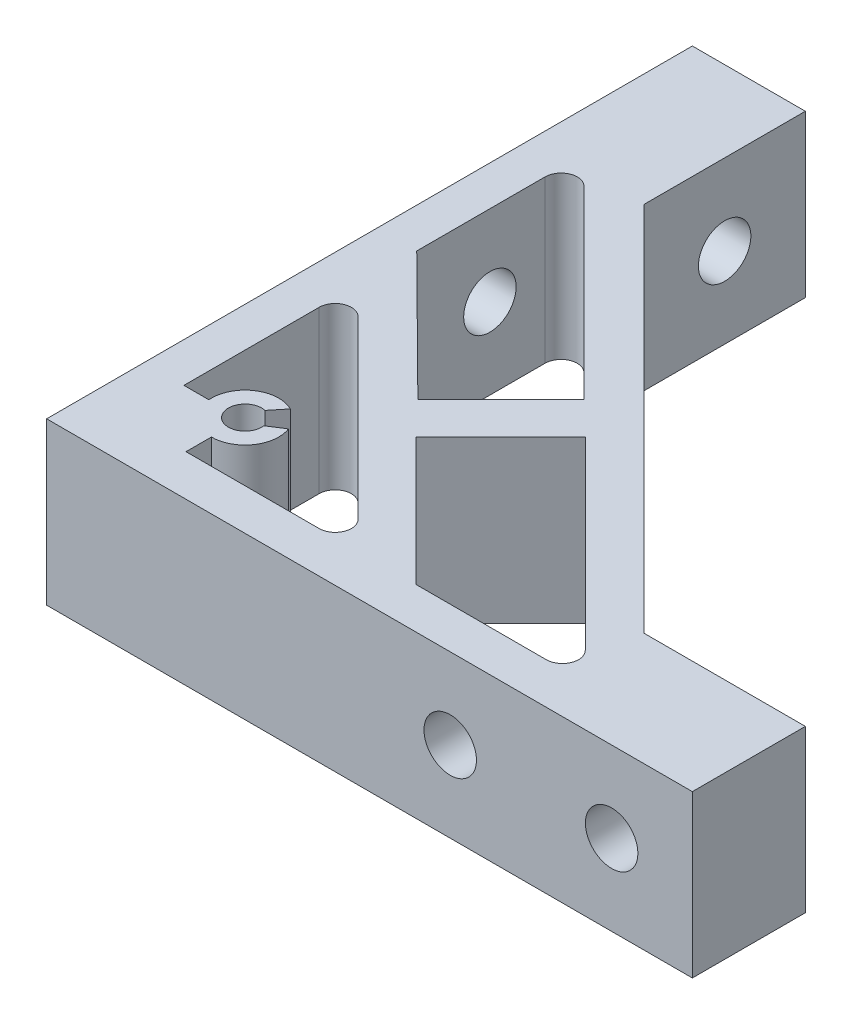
from build123d import *

# Parameters (mm, degrees)
EXTRUDE_1_DEPTH     = 20
SKETCH_2_R          = 3.25
CUT_EXTRUDE_1_DEPTH = 115.891252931
SKETCH_3_R          = 3.25
CUT_EXTRUDE_2_DEPTH = 115.891252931
CUT_EXTRUDE_3_DEPTH = 115.891252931
SKETCH_7_R          = 5.5
CUT_EXTRUDE_4_DEPTH = 25
SKETCH_8_R          = 5.5
CUT_EXTRUDE_5_DEPTH = 25


with BuildPart() as part:
    # Sketch 1 → Extrude 1 (new body)
    with BuildSketch(Plane(origin=(0, 0, 0), x_dir=(1, 0, 0), z_dir=(0, 1, 0))):
        Polygon((0, 80), (0, 0), (80, 0), (80, 14), (60, 14), (14, 60), (14, 80), align=None)
    extrude(amount=EXTRUDE_1_DEPTH)

    # Sketch 2 → Cut-Extrude 1 (cut, through all)
    with BuildSketch(Plane.ZY):
        with Locations((-70, 10)):
            Circle(SKETCH_2_R)
        with Locations((-50, 10)):
            Circle(SKETCH_2_R)
    extrude(amount=-CUT_EXTRUDE_1_DEPTH, mode=Mode.SUBTRACT)

    # Sketch 3 → Cut-Extrude 2 (cut, through all)
    with BuildSketch(Plane.XY):
        with Locations((70, 10)):
            Circle(SKETCH_3_R)
        with Locations((50, 10)):
            Circle(SKETCH_3_R)
    extrude(amount=-CUT_EXTRUDE_2_DEPTH, mode=Mode.SUBTRACT)

    # Sketch 4 → Cut-Extrude 3 (cut, through all)
    with BuildSketch(Plane.XZ):
        with BuildLine():
            Line((20.901080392, -25.090385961), (31.191934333, -35.381239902))
            Line((31.191934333, -35.381239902), (8.330781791, -58.242392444))
            ThreePointArc((8.330781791, -58.242392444), (6.151201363, -58.675937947), (4.916568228, -56.828178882))
            Line((4.916568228, -56.828178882), (4.916568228, -40.934892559))
            Line((4.916568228, -40.934892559), (20.901080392, -25.090385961))
        make_face()
        with BuildLine():
            Line((24.837924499, -20.930281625), (35.319025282, -31.411382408))
            Line((35.319025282, -31.411382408), (58.210769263, -8.519638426))
            ThreePointArc((58.210769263, -8.519638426), (58.644314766, -6.340057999), (56.796555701, -5.105424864))
            Line((56.796555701, -5.105424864), (40.662781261, -5.105424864))
            Line((40.662781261, -5.105424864), (24.837924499, -20.930281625))
        make_face()
        with BuildLine():
            Line((12.160826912, -5.105424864), (28.651360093, -5.105424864))
            ThreePointArc((28.651360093, -5.105424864), (30.499119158, -6.340057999), (30.065573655, -8.519638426))
            Line((30.065573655, -8.519638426), (8.330781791, -30.254430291))
            ThreePointArc((8.330781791, -30.254430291), (6.151201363, -30.687975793), (4.916568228, -28.840216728))
            Line((4.916568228, -28.840216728), (4.916568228, -12.090508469))
            Line((4.916568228, -12.090508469), (8.000520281, -12.090508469))
            ThreePointArc((8.000520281, -12.090508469), (9.82829842, -15.883616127), (14.030107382, -16.154245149))
            Line((14.030107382, -16.154245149), (12.625484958, -14.430268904))
            ThreePointArc((12.625484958, -14.430268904), (10.638085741, -11.03439689), (14.202657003, -12.700390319))
            Line((14.202657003, -12.700390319), (16.06551283, -13.896467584))
            ThreePointArc((16.06551283, -13.896467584), (15.593703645, -10.049139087), (12.160826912, -8.249167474))
            Line((12.160826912, -8.249167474), (12.160826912, -5.105424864))
        make_face()
    extrude(amount=-CUT_EXTRUDE_3_DEPTH, mode=Mode.SUBTRACT)

    # Sketch 7 → Cut-Extrude 4 (cut)
    with BuildSketch(Plane.XY.offset(-35)):
        with Locations(Location((50, 10, 0), (0, 0, 180))):
            Circle(SKETCH_7_R)
    extrude(amount=CUT_EXTRUDE_4_DEPTH, mode=Mode.SUBTRACT)

    # Sketch 8 → Cut-Extrude 5 (cut)
    with BuildSketch(Plane(origin=(35, 0, 0), x_dir=(0, 0, -1), z_dir=(1, 0, 0))):
        with Locations(Location((50, 10, 0), (0, 0, 180))):
            Circle(SKETCH_8_R)
    extrude(amount=-CUT_EXTRUDE_5_DEPTH, mode=Mode.SUBTRACT)


solid = part.part
